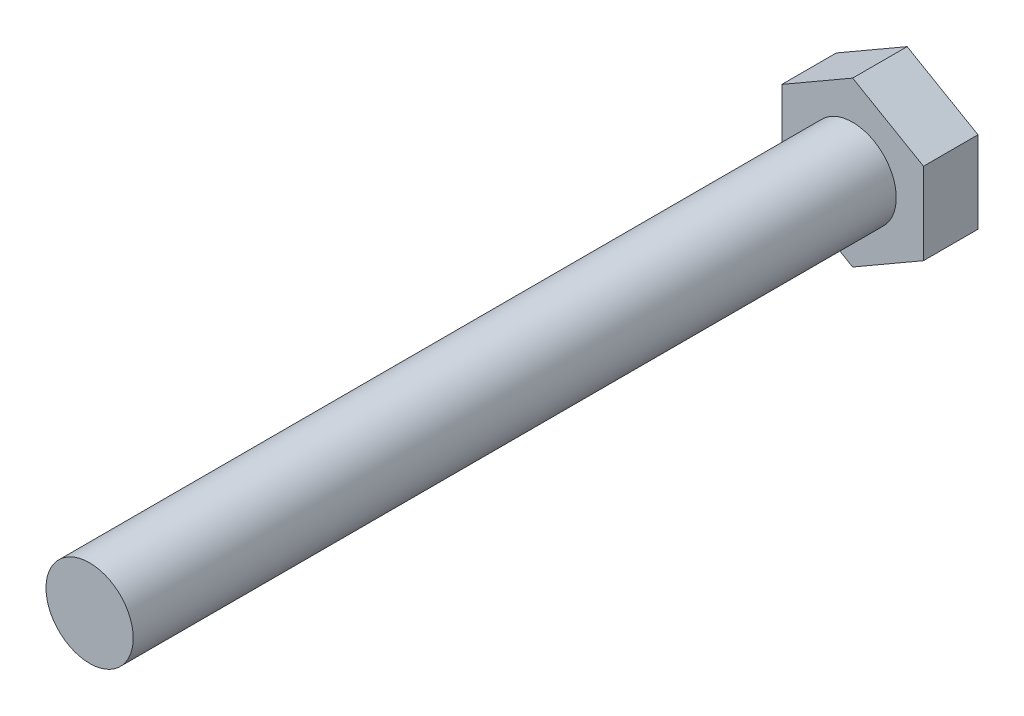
from build123d import *

# Parameters (mm, degrees)
SKETCH1_R      = 4
EXTRUDE1_DEPTH = 70
EXTRUDE2_DEPTH = 5


with BuildPart() as part:
    # Sketch1 → Extrude1 (new body)
    with BuildSketch(Plane.XY):
        Circle(SKETCH1_R)
    extrude(amount=EXTRUDE1_DEPTH)

    # Sketch2 → Extrude2 (add)
    with BuildSketch(Plane(origin=(0, 0, 0), x_dir=(-1, 0, 0), z_dir=(0, 0, -1))):
        Polygon((0, -7.505553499), (6.5, -3.75277675), (6.5, 3.75277675), (0, 7.505553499), (-6.5, 3.75277675), (-6.5, -3.75277675), align=None)
    extrude(amount=EXTRUDE2_DEPTH)


solid = part.part
